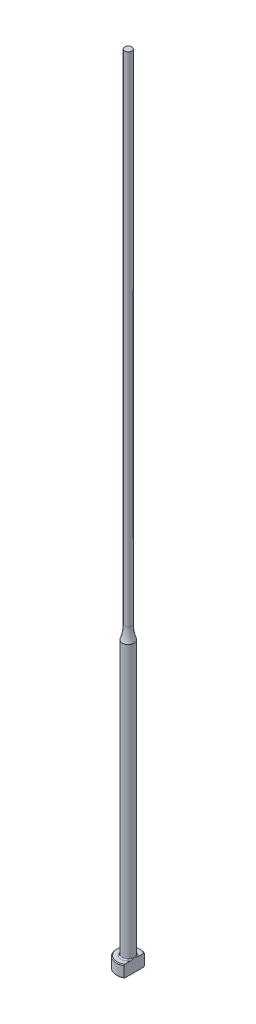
from build123d import *
from build123d.topology import SkipClean

# Parameters (mm, degrees)
CHAMFER1_SIZE = 0.2
FILLET1_R     = 0.3
KEY_DEPTH     = 201.044994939


with BuildPart() as part:
    # Sketch1 → Revolve1 (revolve)
    with BuildSketch(Plane.XY, mode=Mode.PRIVATE) as revolve1_sk:
        with BuildLine():
            Line((0, 0), (-3, 0))
            Line((-3, 0), (-3, 3))
            Line((-3, 3), (-1.5, 3))
            Line((-1.5, 3), (-1.5, 71.588255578))
            ThreePointArc((-1.5, 71.588255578), (-1.051142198, 73.267949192), (-0.9, 75))
            Line((-0.9, 75), (-0.9, 200))
            Line((-0.9, 200), (0, 200))
            Line((0, 200), (0, 0))
        make_face()
    revolve(revolve1_sk.sketch.rotate(Axis((0, 259.958771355, 0), (0, -1, 0)), 270), axis=Axis((0, 259.958771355, 0), (0, -1, 0)))

    # Chamfer1
    chamfer1_edges = [part.edges().sort_by_distance(p)[0] for p in [
        (0, 0, -3),
        (0, 3, -3),
    ]]
    chamfer(chamfer1_edges, length=CHAMFER1_SIZE)

    # Fillet1
    fillet1_edges = [part.edges().sort_by_distance(p)[0] for p in [
        (0, 3, -1.5),
    ]]
    fillet(fillet1_edges, radius=FILLET1_R)

    # Sketch2 → KEY (cut, through all)
    with SkipClean():  # the faces are left unmerged after this step: merging them gives an invalid solid
        with BuildSketch(Plane(origin=(0, 0, 0), x_dir=(1, 0, 0), z_dir=(0, 1, 0))):
            with BuildLine():
                Line((1.5, 2.598076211), (1.5, -2.598076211))
                ThreePointArc((1.5, -2.598076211), (3, 0), (1.5, 2.598076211))
            make_face()
        extrude(amount=KEY_DEPTH, mode=Mode.SUBTRACT)


solid = part.part
